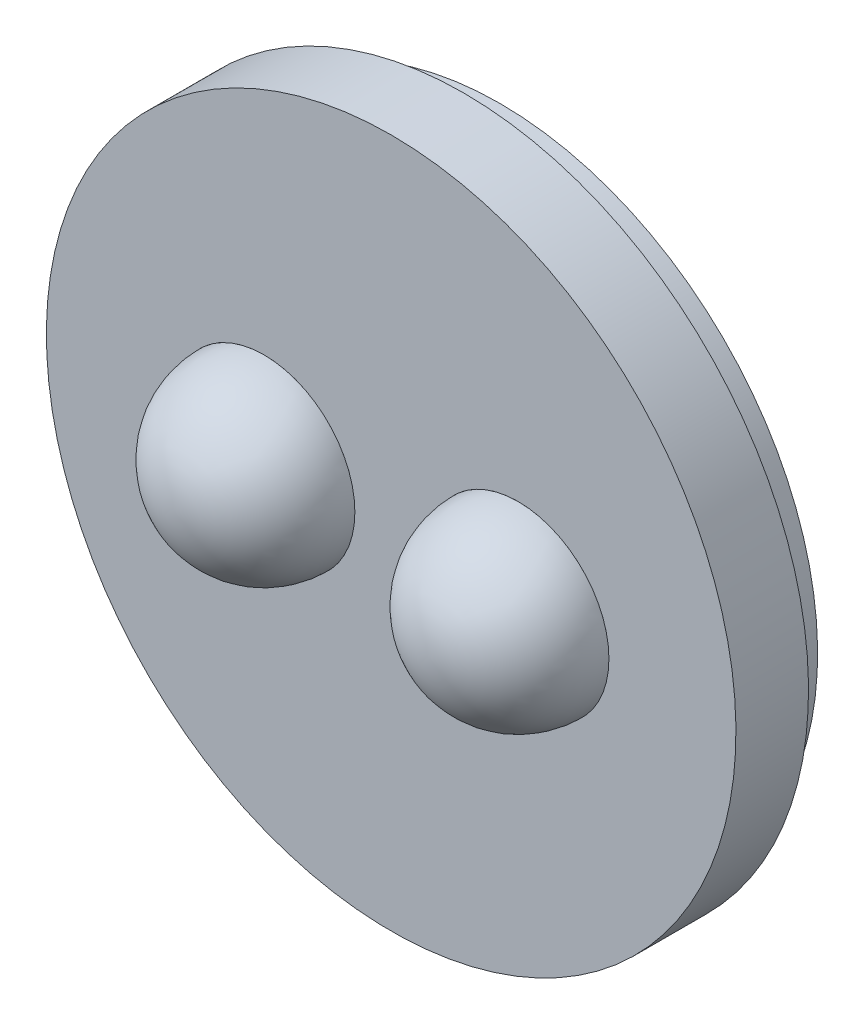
ISO-10303-21;
HEADER;
FILE_DESCRIPTION(('STEP AP214'),'2;1');
FILE_NAME('part.step','',(''),(''),'','','');
FILE_SCHEMA(('AUTOMOTIVE_DESIGN { 1 0 10303 214 1 1 1 1 }'));
ENDSEC;
DATA;
#1=APPLICATION_CONTEXT('core data for automotive mechanical design processes');
#2=APPLICATION_PROTOCOL_DEFINITION('international standard','automotive_design',2000,#1);
#3=PRODUCT_CONTEXT('',#1,'mechanical');
#4=PRODUCT('Part','Part','',(#3));
#5=PRODUCT_RELATED_PRODUCT_CATEGORY('part','',(#4));
#6=PRODUCT_DEFINITION_FORMATION('','',#4);
#7=PRODUCT_DEFINITION_CONTEXT('part definition',#1,'design');
#8=PRODUCT_DEFINITION('design','',#6,#7);
#9=PRODUCT_DEFINITION_SHAPE('','',#8);
#10=(LENGTH_UNIT() NAMED_UNIT(*) SI_UNIT(.MILLI.,.METRE.));
#11=(NAMED_UNIT(*) PLANE_ANGLE_UNIT() SI_UNIT($,.RADIAN.));
#12=(NAMED_UNIT(*) SI_UNIT($,.STERADIAN.) SOLID_ANGLE_UNIT());
#13=UNCERTAINTY_MEASURE_WITH_UNIT(LENGTH_MEASURE(1.E-05),#10,'distance_accuracy_value','');
#14=(GEOMETRIC_REPRESENTATION_CONTEXT(3) GLOBAL_UNCERTAINTY_ASSIGNED_CONTEXT((#13)) GLOBAL_UNIT_ASSIGNED_CONTEXT((#10,
#11,#12)) REPRESENTATION_CONTEXT('',''));
#15=CARTESIAN_POINT('',(0.,0.,0.));
#16=DIRECTION('',(0.,0.,1.));
#17=DIRECTION('',(1.,0.,0.));
#18=AXIS2_PLACEMENT_3D('',#15,#16,#17);
#19=CARTESIAN_POINT('',(44.45,0.,0.));
#20=DIRECTION('',(0.,0.,-1.));
#21=DIRECTION('',(0.,-1.,0.));
#22=AXIS2_PLACEMENT_3D('',#19,#20,#21);
#23=SPHERICAL_SURFACE('',#22,31.75);
#24=CARTESIAN_POINT('',(44.45,0.,0.));
#25=DIRECTION('',(0.,0.,-1.));
#26=DIRECTION('',(0.,1.,0.));
#27=AXIS2_PLACEMENT_3D('',#24,#25,#26);
#28=CIRCLE('',#27,31.75);
#29=CARTESIAN_POINT('',(44.45,31.75,0.));
#30=VERTEX_POINT('',#29);
#31=EDGE_CURVE('E11',#30,#30,#28,.T.);
#32=ORIENTED_EDGE('',*,*,#31,.F.);
#33=EDGE_LOOP('',(#32));
#34=FACE_BOUND('',#33,.T.);
#35=ADVANCED_FACE('F46',(#34),#23,.T.);
#36=CARTESIAN_POINT('',(44.45,0.,0.));
#37=DIRECTION('',(0.,0.,1.));
#38=DIRECTION('',(0.,-1.,0.));
#39=AXIS2_PLACEMENT_3D('',#36,#37,#38);
#40=PLANE('',#39);
#41=ORIENTED_EDGE('',*,*,#31,.T.);
#42=EDGE_LOOP('',(#41));
#43=FACE_BOUND('',#42,.T.);
#44=ADVANCED_FACE('F53',(#43),#40,.F.);
#45=CLOSED_SHELL('',(#35,#44));
#46=MANIFOLD_SOLID_BREP('B2',#45);
#47=CARTESIAN_POINT('',(-44.45,0.,0.));
#48=DIRECTION('',(0.,0.,1.));
#49=DIRECTION('',(0.,-1.,0.));
#50=AXIS2_PLACEMENT_3D('',#47,#48,#49);
#51=PLANE('',#50);
#52=CARTESIAN_POINT('',(-44.45,0.,0.));
#53=DIRECTION('',(0.,0.,-1.));
#54=DIRECTION('',(0.,1.,0.));
#55=AXIS2_PLACEMENT_3D('',#52,#53,#54);
#56=CIRCLE('',#55,31.75);
#57=CARTESIAN_POINT('',(-44.45,31.75,0.));
#58=VERTEX_POINT('',#57);
#59=EDGE_CURVE('E45',#58,#58,#56,.T.);
#60=ORIENTED_EDGE('',*,*,#59,.T.);
#61=EDGE_LOOP('',(#60));
#62=FACE_BOUND('',#61,.T.);
#63=ADVANCED_FACE('F79',(#62),#51,.F.);
#64=CARTESIAN_POINT('',(-44.45,0.,0.));
#65=DIRECTION('',(0.,0.,-1.));
#66=DIRECTION('',(0.,-1.,0.));
#67=AXIS2_PLACEMENT_3D('',#64,#65,#66);
#68=SPHERICAL_SURFACE('',#67,31.75);
#69=ORIENTED_EDGE('',*,*,#59,.F.);
#70=EDGE_LOOP('',(#69));
#71=FACE_BOUND('',#70,.T.);
#72=ADVANCED_FACE('F87',(#71),#68,.T.);
#73=CLOSED_SHELL('',(#63,#72));
#74=MANIFOLD_SOLID_BREP('B6',#73);
#75=CARTESIAN_POINT('',(0.,0.,0.));
#76=DIRECTION('',(0.,0.,1.));
#77=DIRECTION('',(0.,-1.,0.));
#78=AXIS2_PLACEMENT_3D('',#75,#76,#77);
#79=PLANE('',#78);
#80=CARTESIAN_POINT('',(44.45,0.,0.));
#81=DIRECTION('',(0.,0.,1.));
#82=DIRECTION('',(1.,0.,0.));
#83=AXIS2_PLACEMENT_3D('',#80,#81,#82);
#84=CIRCLE('',#83,31.75);
#85=CARTESIAN_POINT('',(76.2,0.,0.));
#86=VERTEX_POINT('',#85);
#87=EDGE_CURVE('E137',#86,#86,#84,.T.);
#88=ORIENTED_EDGE('',*,*,#87,.F.);
#89=EDGE_LOOP('',(#88));
#90=FACE_BOUND('',#89,.T.);
#91=CARTESIAN_POINT('',(-44.45,0.,0.));
#92=DIRECTION('',(0.,0.,1.));
#93=DIRECTION('',(1.,0.,0.));
#94=AXIS2_PLACEMENT_3D('',#91,#92,#93);
#95=CIRCLE('',#94,31.75);
#96=CARTESIAN_POINT('',(-12.7,0.,0.));
#97=VERTEX_POINT('',#96);
#98=EDGE_CURVE('E129',#97,#97,#95,.T.);
#99=ORIENTED_EDGE('',*,*,#98,.F.);
#100=EDGE_LOOP('',(#99));
#101=FACE_BOUND('',#100,.T.);
#102=CARTESIAN_POINT('',(0.,0.,0.));
#103=DIRECTION('',(0.,0.,-1.));
#104=DIRECTION('',(0.,1.,0.));
#105=AXIS2_PLACEMENT_3D('',#102,#103,#104);
#106=CIRCLE('',#105,120.65);
#107=CARTESIAN_POINT('',(0.,120.65,0.));
#108=VERTEX_POINT('',#107);
#109=EDGE_CURVE('E78',#108,#108,#106,.T.);
#110=ORIENTED_EDGE('',*,*,#109,.F.);
#111=EDGE_LOOP('',(#110));
#112=FACE_BOUND('',#111,.T.);
#113=ADVANCED_FACE('F105',(#90,#101,#112),#79,.T.);
#114=CARTESIAN_POINT('',(0.,0.,-38.1));
#115=DIRECTION('',(0.,0.,-1.));
#116=DIRECTION('',(0.,1.,0.));
#117=AXIS2_PLACEMENT_3D('',#114,#115,#116);
#118=CYLINDRICAL_SURFACE('',#117,120.65);
#119=ORIENTED_EDGE('',*,*,#109,.T.);
#120=EDGE_LOOP('',(#119));
#121=FACE_BOUND('',#120,.T.);
#122=CARTESIAN_POINT('',(0.,0.,-25.4));
#123=DIRECTION('',(0.,0.,-1.));
#124=DIRECTION('',(0.,1.,0.));
#125=AXIS2_PLACEMENT_3D('',#122,#123,#124);
#126=CIRCLE('',#125,120.65);
#127=CARTESIAN_POINT('',(0.,120.65,-25.4));
#128=VERTEX_POINT('',#127);
#129=EDGE_CURVE('E112',#128,#128,#126,.T.);
#130=ORIENTED_EDGE('',*,*,#129,.F.);
#131=EDGE_LOOP('',(#130));
#132=FACE_BOUND('',#131,.T.);
#133=ADVANCED_FACE('F157',(#121,#132),#118,.T.);
#134=CARTESIAN_POINT('',(0.,120.65,-25.4));
#135=DIRECTION('',(0.,0.,-1.));
#136=DIRECTION('',(0.,1.,0.));
#137=AXIS2_PLACEMENT_3D('',#134,#135,#136);
#138=PLANE('',#137);
#139=ORIENTED_EDGE('',*,*,#129,.T.);
#140=EDGE_LOOP('',(#139));
#141=FACE_BOUND('',#140,.T.);
#142=CARTESIAN_POINT('',(0.,0.,-25.4));
#143=DIRECTION('',(0.,0.,-1.));
#144=DIRECTION('',(0.,1.,0.));
#145=AXIS2_PLACEMENT_3D('',#142,#143,#144);
#146=CIRCLE('',#145,111.125);
#147=CARTESIAN_POINT('',(0.,111.125,-25.4));
#148=VERTEX_POINT('',#147);
#149=EDGE_CURVE('E117',#148,#148,#146,.T.);
#150=ORIENTED_EDGE('',*,*,#149,.F.);
#151=EDGE_LOOP('',(#150));
#152=FACE_BOUND('',#151,.T.);
#153=ADVANCED_FACE('F173',(#141,#152),#138,.T.);
#154=CARTESIAN_POINT('',(0.,0.,-38.1));
#155=DIRECTION('',(0.,0.,-1.));
#156=DIRECTION('',(0.,1.,0.));
#157=AXIS2_PLACEMENT_3D('',#154,#155,#156);
#158=CYLINDRICAL_SURFACE('',#157,111.125);
#159=ORIENTED_EDGE('',*,*,#149,.T.);
#160=EDGE_LOOP('',(#159));
#161=FACE_BOUND('',#160,.T.);
#162=CARTESIAN_POINT('',(0.,0.,-38.1));
#163=DIRECTION('',(0.,0.,-1.));
#164=DIRECTION('',(0.,1.,0.));
#165=AXIS2_PLACEMENT_3D('',#162,#163,#164);
#166=CIRCLE('',#165,111.125);
#167=CARTESIAN_POINT('',(0.,111.125,-38.1));
#168=VERTEX_POINT('',#167);
#169=EDGE_CURVE('E122',#168,#168,#166,.T.);
#170=ORIENTED_EDGE('',*,*,#169,.F.);
#171=EDGE_LOOP('',(#170));
#172=FACE_BOUND('',#171,.T.);
#173=ADVANCED_FACE('F167',(#161,#172),#158,.T.);
#174=CARTESIAN_POINT('',(0.,111.125,-38.1));
#175=DIRECTION('',(0.,0.,-1.));
#176=DIRECTION('',(0.,1.,0.));
#177=AXIS2_PLACEMENT_3D('',#174,#175,#176);
#178=PLANE('',#177);
#179=CARTESIAN_POINT('',(44.45,0.,-38.1));
#180=DIRECTION('',(0.,0.,1.));
#181=DIRECTION('',(1.,0.,0.));
#182=AXIS2_PLACEMENT_3D('',#179,#180,#181);
#183=CIRCLE('',#182,31.75);
#184=CARTESIAN_POINT('',(76.2,0.,-38.1));
#185=VERTEX_POINT('',#184);
#186=EDGE_CURVE('E128',#185,#185,#183,.T.);
#187=ORIENTED_EDGE('',*,*,#186,.T.);
#188=EDGE_LOOP('',(#187));
#189=FACE_BOUND('',#188,.T.);
#190=CARTESIAN_POINT('',(-44.45,0.,-38.1));
#191=DIRECTION('',(0.,0.,1.));
#192=DIRECTION('',(1.,0.,0.));
#193=AXIS2_PLACEMENT_3D('',#190,#191,#192);
#194=CIRCLE('',#193,31.75);
#195=CARTESIAN_POINT('',(-12.7,0.,-38.1));
#196=VERTEX_POINT('',#195);
#197=EDGE_CURVE('E133',#196,#196,#194,.T.);
#198=ORIENTED_EDGE('',*,*,#197,.T.);
#199=EDGE_LOOP('',(#198));
#200=FACE_BOUND('',#199,.T.);
#201=ORIENTED_EDGE('',*,*,#169,.T.);
#202=EDGE_LOOP('',(#201));
#203=FACE_BOUND('',#202,.T.);
#204=ADVANCED_FACE('F145',(#189,#200,#203),#178,.T.);
#205=CARTESIAN_POINT('',(-44.45,0.,-38.1));
#206=DIRECTION('',(0.,0.,1.));
#207=DIRECTION('',(1.,0.,0.));
#208=AXIS2_PLACEMENT_3D('',#205,#206,#207);
#209=CYLINDRICAL_SURFACE('',#208,31.75);
#210=ORIENTED_EDGE('',*,*,#197,.F.);
#211=EDGE_LOOP('',(#210));
#212=FACE_BOUND('',#211,.T.);
#213=ORIENTED_EDGE('',*,*,#98,.T.);
#214=EDGE_LOOP('',(#213));
#215=FACE_BOUND('',#214,.T.);
#216=ADVANCED_FACE('F151',(#212,#215),#209,.F.);
#217=CARTESIAN_POINT('',(44.45,0.,-38.1));
#218=DIRECTION('',(0.,0.,1.));
#219=DIRECTION('',(1.,0.,0.));
#220=AXIS2_PLACEMENT_3D('',#217,#218,#219);
#221=CYLINDRICAL_SURFACE('',#220,31.75);
#222=ORIENTED_EDGE('',*,*,#186,.F.);
#223=EDGE_LOOP('',(#222));
#224=FACE_BOUND('',#223,.T.);
#225=ORIENTED_EDGE('',*,*,#87,.T.);
#226=EDGE_LOOP('',(#225));
#227=FACE_BOUND('',#226,.T.);
#228=ADVANCED_FACE('F148',(#224,#227),#221,.F.);
#229=CLOSED_SHELL('',(#113,#133,#153,#173,#204,#216,#228));
#230=MANIFOLD_SOLID_BREP('B40',#229);
#231=ADVANCED_BREP_SHAPE_REPRESENTATION('',(#18,#46,#74,#230),#14);
#232=SHAPE_DEFINITION_REPRESENTATION(#9,#231);
ENDSEC;
END-ISO-10303-21;
